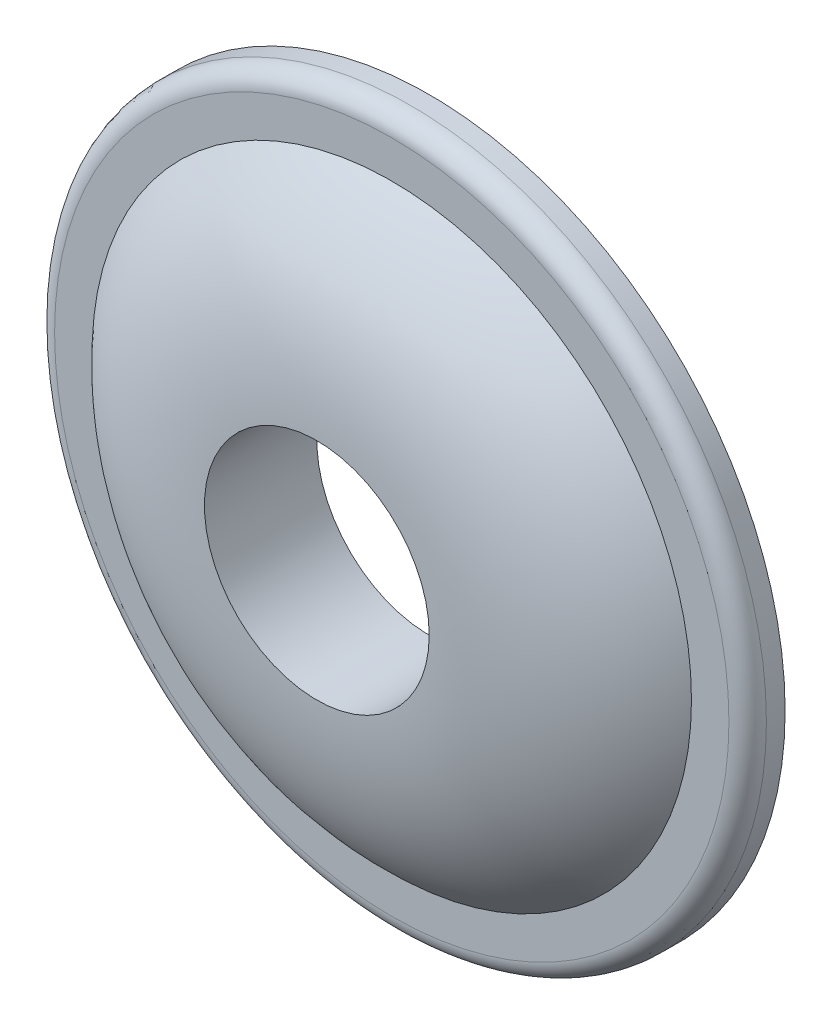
ISO-10303-21;
HEADER;
FILE_DESCRIPTION(('STEP AP214'),'2;1');
FILE_NAME('part.step','',(''),(''),'','','');
FILE_SCHEMA(('AUTOMOTIVE_DESIGN { 1 0 10303 214 1 1 1 1 }'));
ENDSEC;
DATA;
#1=APPLICATION_CONTEXT('core data for automotive mechanical design processes');
#2=APPLICATION_PROTOCOL_DEFINITION('international standard','automotive_design',2000,#1);
#3=PRODUCT_CONTEXT('',#1,'mechanical');
#4=PRODUCT('Part','Part','',(#3));
#5=PRODUCT_RELATED_PRODUCT_CATEGORY('part','',(#4));
#6=PRODUCT_DEFINITION_FORMATION('','',#4);
#7=PRODUCT_DEFINITION_CONTEXT('part definition',#1,'design');
#8=PRODUCT_DEFINITION('design','',#6,#7);
#9=PRODUCT_DEFINITION_SHAPE('','',#8);
#10=(LENGTH_UNIT() NAMED_UNIT(*) SI_UNIT(.MILLI.,.METRE.));
#11=(NAMED_UNIT(*) PLANE_ANGLE_UNIT() SI_UNIT($,.RADIAN.));
#12=(NAMED_UNIT(*) SI_UNIT($,.STERADIAN.) SOLID_ANGLE_UNIT());
#13=UNCERTAINTY_MEASURE_WITH_UNIT(LENGTH_MEASURE(1.E-05),#10,'distance_accuracy_value','');
#14=(GEOMETRIC_REPRESENTATION_CONTEXT(3) GLOBAL_UNCERTAINTY_ASSIGNED_CONTEXT((#13)) GLOBAL_UNIT_ASSIGNED_CONTEXT((#10,
#11,#12)) REPRESENTATION_CONTEXT('',''));
#15=CARTESIAN_POINT('',(0.,0.,0.));
#16=DIRECTION('',(0.,0.,1.));
#17=DIRECTION('',(1.,0.,0.));
#18=AXIS2_PLACEMENT_3D('',#15,#16,#17);
#19=CARTESIAN_POINT('',(0.,8.,-2.));
#20=CARTESIAN_POINT('',(0.,6.20034879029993,0.));
#21=CARTESIAN_POINT('',(0.,3.,0.));
#22=B_SPLINE_CURVE_WITH_KNOTS('',2,(#19,#20,#21),.UNSPECIFIED.,.F.,.F.,(3,3),(0.,1.),.UNSPECIFIED.);
#23=CARTESIAN_POINT('',(0.,0.,0.));
#24=DIRECTION('',(0.,0.,1.));
#25=AXIS1_PLACEMENT('',#23,#24);
#26=SURFACE_OF_REVOLUTION('',#22,#25);
#27=CARTESIAN_POINT('',(0.,0.,0.));
#28=DIRECTION('',(0.,0.,1.));
#29=DIRECTION('',(1.,0.,0.));
#30=AXIS2_PLACEMENT_3D('',#27,#28,#29);
#31=CIRCLE('',#30,3.);
#32=CARTESIAN_POINT('',(3.,0.,0.));
#33=VERTEX_POINT('',#32);
#34=EDGE_CURVE('E10',#33,#33,#31,.T.);
#35=ORIENTED_EDGE('',*,*,#34,.F.);
#36=EDGE_LOOP('',(#35));
#37=FACE_BOUND('',#36,.T.);
#38=CARTESIAN_POINT('',(0.,0.,-2.));
#39=DIRECTION('',(0.,0.,1.));
#40=DIRECTION('',(1.,0.,0.));
#41=AXIS2_PLACEMENT_3D('',#38,#39,#40);
#42=CIRCLE('',#41,8.);
#43=CARTESIAN_POINT('',(8.,0.,-2.));
#44=VERTEX_POINT('',#43);
#45=EDGE_CURVE('E52',#44,#44,#42,.T.);
#46=ORIENTED_EDGE('',*,*,#45,.T.);
#47=EDGE_LOOP('',(#46));
#48=FACE_BOUND('',#47,.T.);
#49=ADVANCED_FACE('F29',(#37,#48),#26,.T.);
#50=CARTESIAN_POINT('',(0.,0.,0.));
#51=DIRECTION('',(0.,0.,1.));
#52=DIRECTION('',(1.,0.,0.));
#53=AXIS2_PLACEMENT_3D('',#50,#51,#52);
#54=CYLINDRICAL_SURFACE('',#53,3.);
#55=CARTESIAN_POINT('',(0.,0.,-3.));
#56=DIRECTION('',(0.,0.,1.));
#57=DIRECTION('',(1.,0.,0.));
#58=AXIS2_PLACEMENT_3D('',#55,#56,#57);
#59=CIRCLE('',#58,3.);
#60=CARTESIAN_POINT('',(3.,0.,-3.));
#61=VERTEX_POINT('',#60);
#62=EDGE_CURVE('E36',#61,#61,#59,.T.);
#63=ORIENTED_EDGE('',*,*,#62,.F.);
#64=EDGE_LOOP('',(#63));
#65=FACE_BOUND('',#64,.T.);
#66=ORIENTED_EDGE('',*,*,#34,.T.);
#67=EDGE_LOOP('',(#66));
#68=FACE_BOUND('',#67,.T.);
#69=ADVANCED_FACE('F83',(#65,#68),#54,.F.);
#70=CARTESIAN_POINT('',(0.,3.,-3.));
#71=DIRECTION('',(0.,0.,1.));
#72=DIRECTION('',(1.,0.,0.));
#73=AXIS2_PLACEMENT_3D('',#70,#71,#72);
#74=PLANE('',#73);
#75=CARTESIAN_POINT('',(0.,0.,-3.));
#76=DIRECTION('',(0.,0.,1.));
#77=DIRECTION('',(1.,0.,0.));
#78=AXIS2_PLACEMENT_3D('',#75,#76,#77);
#79=CIRCLE('',#78,9.5);
#80=CARTESIAN_POINT('',(9.5,0.,-3.));
#81=VERTEX_POINT('',#80);
#82=EDGE_CURVE('E40',#81,#81,#79,.T.);
#83=ORIENTED_EDGE('',*,*,#82,.F.);
#84=EDGE_LOOP('',(#83));
#85=FACE_BOUND('',#84,.T.);
#86=ORIENTED_EDGE('',*,*,#62,.T.);
#87=EDGE_LOOP('',(#86));
#88=FACE_BOUND('',#87,.T.);
#89=ADVANCED_FACE('F78',(#85,#88),#74,.F.);
#90=CARTESIAN_POINT('',(0.,0.,0.));
#91=DIRECTION('',(0.,0.,1.));
#92=DIRECTION('',(1.,0.,0.));
#93=AXIS2_PLACEMENT_3D('',#90,#91,#92);
#94=CYLINDRICAL_SURFACE('',#93,9.5);
#95=CARTESIAN_POINT('',(0.,0.,-2.5));
#96=DIRECTION('',(0.,0.,1.));
#97=DIRECTION('',(1.,0.,0.));
#98=AXIS2_PLACEMENT_3D('',#95,#96,#97);
#99=CIRCLE('',#98,9.5);
#100=CARTESIAN_POINT('',(9.5,0.,-2.5));
#101=VERTEX_POINT('',#100);
#102=EDGE_CURVE('E44',#101,#101,#99,.T.);
#103=ORIENTED_EDGE('',*,*,#102,.F.);
#104=EDGE_LOOP('',(#103));
#105=FACE_BOUND('',#104,.T.);
#106=ORIENTED_EDGE('',*,*,#82,.T.);
#107=EDGE_LOOP('',(#106));
#108=FACE_BOUND('',#107,.T.);
#109=ADVANCED_FACE('F72',(#105,#108),#94,.T.);
#110=CARTESIAN_POINT('',(0.,0.,-2.5));
#111=DIRECTION('',(0.,0.,1.));
#112=DIRECTION('',(1.,0.,0.));
#113=AXIS2_PLACEMENT_3D('',#110,#111,#112);
#114=TOROIDAL_SURFACE('',#113,9.,0.5);
#115=CARTESIAN_POINT('',(0.,0.,-2.));
#116=DIRECTION('',(0.,0.,1.));
#117=DIRECTION('',(1.,0.,0.));
#118=AXIS2_PLACEMENT_3D('',#115,#116,#117);
#119=CIRCLE('',#118,9.);
#120=CARTESIAN_POINT('',(9.,0.,-2.));
#121=VERTEX_POINT('',#120);
#122=EDGE_CURVE('E49',#121,#121,#119,.T.);
#123=ORIENTED_EDGE('',*,*,#122,.F.);
#124=EDGE_LOOP('',(#123));
#125=FACE_BOUND('',#124,.T.);
#126=ORIENTED_EDGE('',*,*,#102,.T.);
#127=EDGE_LOOP('',(#126));
#128=FACE_BOUND('',#127,.T.);
#129=ADVANCED_FACE('F66',(#125,#128),#114,.T.);
#130=CARTESIAN_POINT('',(0.,9.,-2.));
#131=DIRECTION('',(0.,0.,-1.));
#132=DIRECTION('',(-1.,0.,0.));
#133=AXIS2_PLACEMENT_3D('',#130,#131,#132);
#134=PLANE('',#133);
#135=ORIENTED_EDGE('',*,*,#45,.F.);
#136=EDGE_LOOP('',(#135));
#137=FACE_BOUND('',#136,.T.);
#138=ORIENTED_EDGE('',*,*,#122,.T.);
#139=EDGE_LOOP('',(#138));
#140=FACE_BOUND('',#139,.T.);
#141=ADVANCED_FACE('F63',(#137,#140),#134,.F.);
#142=CLOSED_SHELL('',(#49,#69,#89,#109,#129,#141));
#143=MANIFOLD_SOLID_BREP('B2',#142);
#144=ADVANCED_BREP_SHAPE_REPRESENTATION('',(#18,#143),#14);
#145=SHAPE_DEFINITION_REPRESENTATION(#9,#144);
ENDSEC;
END-ISO-10303-21;
